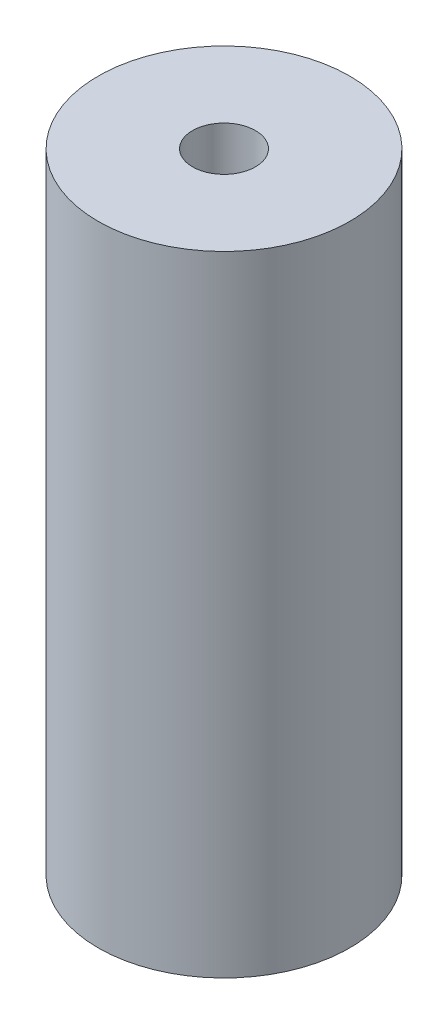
ISO-10303-21;
HEADER;
FILE_DESCRIPTION(('STEP AP214'),'2;1');
FILE_NAME('part.step','',(''),(''),'','','');
FILE_SCHEMA(('AUTOMOTIVE_DESIGN { 1 0 10303 214 1 1 1 1 }'));
ENDSEC;
DATA;
#1=APPLICATION_CONTEXT('core data for automotive mechanical design processes');
#2=APPLICATION_PROTOCOL_DEFINITION('international standard','automotive_design',2000,#1);
#3=PRODUCT_CONTEXT('',#1,'mechanical');
#4=PRODUCT('Part','Part','',(#3));
#5=PRODUCT_RELATED_PRODUCT_CATEGORY('part','',(#4));
#6=PRODUCT_DEFINITION_FORMATION('','',#4);
#7=PRODUCT_DEFINITION_CONTEXT('part definition',#1,'design');
#8=PRODUCT_DEFINITION('design','',#6,#7);
#9=PRODUCT_DEFINITION_SHAPE('','',#8);
#10=(LENGTH_UNIT() NAMED_UNIT(*) SI_UNIT(.MILLI.,.METRE.));
#11=(NAMED_UNIT(*) PLANE_ANGLE_UNIT() SI_UNIT($,.RADIAN.));
#12=(NAMED_UNIT(*) SI_UNIT($,.STERADIAN.) SOLID_ANGLE_UNIT());
#13=UNCERTAINTY_MEASURE_WITH_UNIT(LENGTH_MEASURE(1.E-05),#10,'distance_accuracy_value','');
#14=(GEOMETRIC_REPRESENTATION_CONTEXT(3) GLOBAL_UNCERTAINTY_ASSIGNED_CONTEXT((#13)) GLOBAL_UNIT_ASSIGNED_CONTEXT((#10,
#11,#12)) REPRESENTATION_CONTEXT('',''));
#15=CARTESIAN_POINT('',(0.,0.,0.));
#16=DIRECTION('',(0.,0.,1.));
#17=DIRECTION('',(1.,0.,0.));
#18=AXIS2_PLACEMENT_3D('',#15,#16,#17);
#19=CARTESIAN_POINT('',(0.,63.5,0.));
#20=DIRECTION('',(0.,1.,0.));
#21=DIRECTION('',(0.,0.,1.));
#22=AXIS2_PLACEMENT_3D('',#19,#20,#21);
#23=PLANE('',#22);
#24=CARTESIAN_POINT('',(0.,63.5,0.));
#25=DIRECTION('',(0.,1.,0.));
#26=DIRECTION('',(0.,0.,1.));
#27=AXIS2_PLACEMENT_3D('',#24,#25,#26);
#28=CIRCLE('',#27,12.7);
#29=CARTESIAN_POINT('',(0.,63.5,12.7));
#30=VERTEX_POINT('',#29);
#31=EDGE_CURVE('E11',#30,#30,#28,.T.);
#32=ORIENTED_EDGE('',*,*,#31,.T.);
#33=EDGE_LOOP('',(#32));
#34=FACE_BOUND('',#33,.T.);
#35=CARTESIAN_POINT('',(0.,63.5,0.));
#36=DIRECTION('',(0.,1.,0.));
#37=DIRECTION('',(0.,0.,1.));
#38=AXIS2_PLACEMENT_3D('',#35,#36,#37);
#39=CIRCLE('',#38,3.175);
#40=CARTESIAN_POINT('',(0.,63.5,3.175));
#41=VERTEX_POINT('',#40);
#42=EDGE_CURVE('E68',#41,#41,#39,.T.);
#43=ORIENTED_EDGE('',*,*,#42,.F.);
#44=EDGE_LOOP('',(#43));
#45=FACE_BOUND('',#44,.T.);
#46=ADVANCED_FACE('F32',(#34,#45),#23,.T.);
#47=CARTESIAN_POINT('',(0.,0.,0.));
#48=DIRECTION('',(0.,1.,0.));
#49=DIRECTION('',(0.,0.,1.));
#50=AXIS2_PLACEMENT_3D('',#47,#48,#49);
#51=PLANE('',#50);
#52=CARTESIAN_POINT('',(-7.9375,0.,0.));
#53=DIRECTION('',(0.,-1.,0.));
#54=DIRECTION('',(0.,0.,-1.));
#55=AXIS2_PLACEMENT_3D('',#52,#53,#54);
#56=CIRCLE('',#55,1.43509999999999);
#57=CARTESIAN_POINT('',(-7.9375,0.,-1.43509999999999));
#58=VERTEX_POINT('',#57);
#59=EDGE_CURVE('E57',#58,#58,#56,.T.);
#60=ORIENTED_EDGE('',*,*,#59,.F.);
#61=EDGE_LOOP('',(#60));
#62=FACE_BOUND('',#61,.T.);
#63=CARTESIAN_POINT('',(7.9375,0.,0.));
#64=DIRECTION('',(0.,-1.,0.));
#65=DIRECTION('',(0.,0.,-1.));
#66=AXIS2_PLACEMENT_3D('',#63,#64,#65);
#67=CIRCLE('',#66,1.43509999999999);
#68=CARTESIAN_POINT('',(7.9375,0.,-1.43509999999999));
#69=VERTEX_POINT('',#68);
#70=EDGE_CURVE('E56',#69,#69,#67,.T.);
#71=ORIENTED_EDGE('',*,*,#70,.F.);
#72=EDGE_LOOP('',(#71));
#73=FACE_BOUND('',#72,.T.);
#74=CARTESIAN_POINT('',(0.,0.,0.));
#75=DIRECTION('',(0.,1.,0.));
#76=DIRECTION('',(0.,0.,1.));
#77=AXIS2_PLACEMENT_3D('',#74,#75,#76);
#78=CIRCLE('',#77,12.7);
#79=CARTESIAN_POINT('',(0.,0.,12.7));
#80=VERTEX_POINT('',#79);
#81=EDGE_CURVE('E36',#80,#80,#78,.T.);
#82=ORIENTED_EDGE('',*,*,#81,.F.);
#83=EDGE_LOOP('',(#82));
#84=FACE_BOUND('',#83,.T.);
#85=CARTESIAN_POINT('',(0.,0.,0.));
#86=DIRECTION('',(0.,1.,0.));
#87=DIRECTION('',(0.,0.,1.));
#88=AXIS2_PLACEMENT_3D('',#85,#86,#87);
#89=CIRCLE('',#88,3.175);
#90=CARTESIAN_POINT('',(0.,0.,3.175));
#91=VERTEX_POINT('',#90);
#92=EDGE_CURVE('E67',#91,#91,#89,.T.);
#93=ORIENTED_EDGE('',*,*,#92,.T.);
#94=EDGE_LOOP('',(#93));
#95=FACE_BOUND('',#94,.T.);
#96=ADVANCED_FACE('F74',(#62,#73,#84,#95),#51,.F.);
#97=CARTESIAN_POINT('',(0.,63.5,0.));
#98=DIRECTION('',(0.,-1.,0.));
#99=DIRECTION('',(0.,0.,-1.));
#100=AXIS2_PLACEMENT_3D('',#97,#98,#99);
#101=CYLINDRICAL_SURFACE('',#100,12.7);
#102=ORIENTED_EDGE('',*,*,#31,.F.);
#103=EDGE_LOOP('',(#102));
#104=FACE_BOUND('',#103,.T.);
#105=ORIENTED_EDGE('',*,*,#81,.T.);
#106=EDGE_LOOP('',(#105));
#107=FACE_BOUND('',#106,.T.);
#108=ADVANCED_FACE('F34',(#104,#107),#101,.T.);
#109=CARTESIAN_POINT('',(0.,63.5,0.));
#110=DIRECTION('',(0.,-1.,0.));
#111=DIRECTION('',(0.,0.,-1.));
#112=AXIS2_PLACEMENT_3D('',#109,#110,#111);
#113=CYLINDRICAL_SURFACE('',#112,3.175);
#114=ORIENTED_EDGE('',*,*,#42,.T.);
#115=EDGE_LOOP('',(#114));
#116=FACE_BOUND('',#115,.T.);
#117=ORIENTED_EDGE('',*,*,#92,.F.);
#118=EDGE_LOOP('',(#117));
#119=FACE_BOUND('',#118,.T.);
#120=ADVANCED_FACE('F76',(#116,#119),#113,.F.);
#121=CARTESIAN_POINT('',(7.9375,25.4,0.));
#122=DIRECTION('',(0.,-1.,0.));
#123=DIRECTION('',(0.,0.,-1.));
#124=AXIS2_PLACEMENT_3D('',#121,#122,#123);
#125=CONICAL_SURFACE('',#124,1.43509999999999,1.02974425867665);
#126=CARTESIAN_POINT('',(7.93749999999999,26.2622950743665,0.));
#127=VERTEX_POINT('',#126);
#128=VERTEX_LOOP('',#127);
#129=FACE_BOUND('',#128,.T.);
#130=CARTESIAN_POINT('',(7.9375,25.4,0.));
#131=DIRECTION('',(0.,-1.,0.));
#132=DIRECTION('',(0.,0.,-1.));
#133=AXIS2_PLACEMENT_3D('',#130,#131,#132);
#134=CIRCLE('',#133,1.43509999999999);
#135=CARTESIAN_POINT('',(7.9375,25.4,-1.43509999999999));
#136=VERTEX_POINT('',#135);
#137=EDGE_CURVE('E60',#136,#136,#134,.T.);
#138=ORIENTED_EDGE('',*,*,#137,.T.);
#139=EDGE_LOOP('',(#138));
#140=FACE_BOUND('',#139,.T.);
#141=ADVANCED_FACE('F78',(#129,#140),#125,.F.);
#142=CARTESIAN_POINT('',(7.9375,0.,0.));
#143=DIRECTION('',(0.,-1.,0.));
#144=DIRECTION('',(0.,0.,-1.));
#145=AXIS2_PLACEMENT_3D('',#142,#143,#144);
#146=CYLINDRICAL_SURFACE('',#145,1.43509999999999);
#147=ORIENTED_EDGE('',*,*,#137,.F.);
#148=EDGE_LOOP('',(#147));
#149=FACE_BOUND('',#148,.T.);
#150=ORIENTED_EDGE('',*,*,#70,.T.);
#151=EDGE_LOOP('',(#150));
#152=FACE_BOUND('',#151,.T.);
#153=ADVANCED_FACE('F50',(#149,#152),#146,.F.);
#154=CARTESIAN_POINT('',(-7.9375,25.4,0.));
#155=DIRECTION('',(0.,-1.,0.));
#156=DIRECTION('',(0.,0.,-1.));
#157=AXIS2_PLACEMENT_3D('',#154,#155,#156);
#158=CONICAL_SURFACE('',#157,1.43509999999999,1.02974425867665);
#159=CARTESIAN_POINT('',(-7.93750000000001,26.2622950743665,0.));
#160=VERTEX_POINT('',#159);
#161=VERTEX_LOOP('',#160);
#162=FACE_BOUND('',#161,.T.);
#163=CARTESIAN_POINT('',(-7.9375,25.4,0.));
#164=DIRECTION('',(0.,-1.,0.));
#165=DIRECTION('',(0.,0.,-1.));
#166=AXIS2_PLACEMENT_3D('',#163,#164,#165);
#167=CIRCLE('',#166,1.43509999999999);
#168=CARTESIAN_POINT('',(-7.9375,25.4,-1.43509999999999));
#169=VERTEX_POINT('',#168);
#170=EDGE_CURVE('E54',#169,#169,#167,.T.);
#171=ORIENTED_EDGE('',*,*,#170,.T.);
#172=EDGE_LOOP('',(#171));
#173=FACE_BOUND('',#172,.T.);
#174=ADVANCED_FACE('F46',(#162,#173),#158,.F.);
#175=CARTESIAN_POINT('',(-7.9375,0.,0.));
#176=DIRECTION('',(0.,-1.,0.));
#177=DIRECTION('',(0.,0.,-1.));
#178=AXIS2_PLACEMENT_3D('',#175,#176,#177);
#179=CYLINDRICAL_SURFACE('',#178,1.43509999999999);
#180=ORIENTED_EDGE('',*,*,#170,.F.);
#181=EDGE_LOOP('',(#180));
#182=FACE_BOUND('',#181,.T.);
#183=ORIENTED_EDGE('',*,*,#59,.T.);
#184=EDGE_LOOP('',(#183));
#185=FACE_BOUND('',#184,.T.);
#186=ADVANCED_FACE('F49',(#182,#185),#179,.F.);
#187=CLOSED_SHELL('',(#46,#96,#108,#120,#141,#153,#174,#186));
#188=MANIFOLD_SOLID_BREP('B2',#187);
#189=ADVANCED_BREP_SHAPE_REPRESENTATION('',(#18,#188),#14);
#190=SHAPE_DEFINITION_REPRESENTATION(#9,#189);
ENDSEC;
END-ISO-10303-21;
